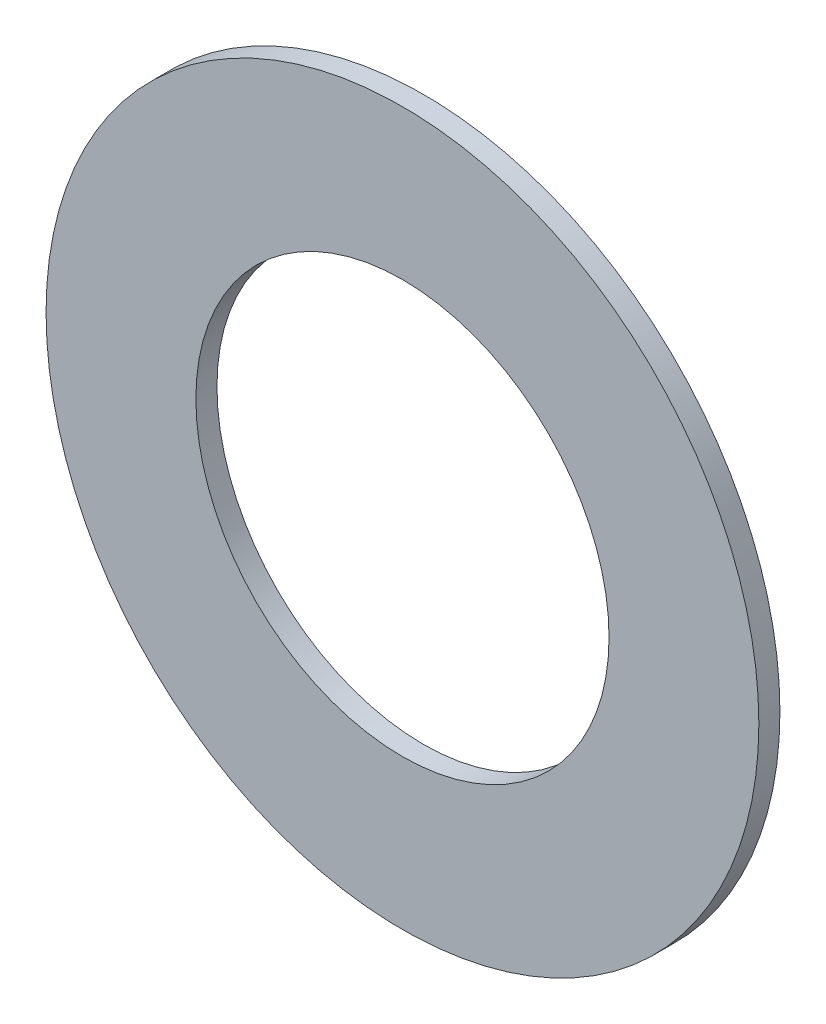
from build123d import *

# Parameters (mm, degrees)
SKETCH2_R           = 53.680215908
SKETCH2_R_2         = 31.115
BOSS_EXTRUDE1_DEPTH = 1.5875


with BuildPart() as part:
    # Sketch2 → Boss-Extrude1 (new, symmetric)
    with BuildSketch(Plane(origin=(0, 0, 0), x_dir=(0, 1, 0), z_dir=(0, 0, 1))):
        with Locations(Location((0, 0, 0), (0, 0, 270))):
            Circle(SKETCH2_R)
        with Locations(Location((0, 0, 0), (0, 0, 270))):
            Circle(SKETCH2_R_2, mode=Mode.SUBTRACT)
    extrude(amount=BOSS_EXTRUDE1_DEPTH, both=True)


solid = part.part
